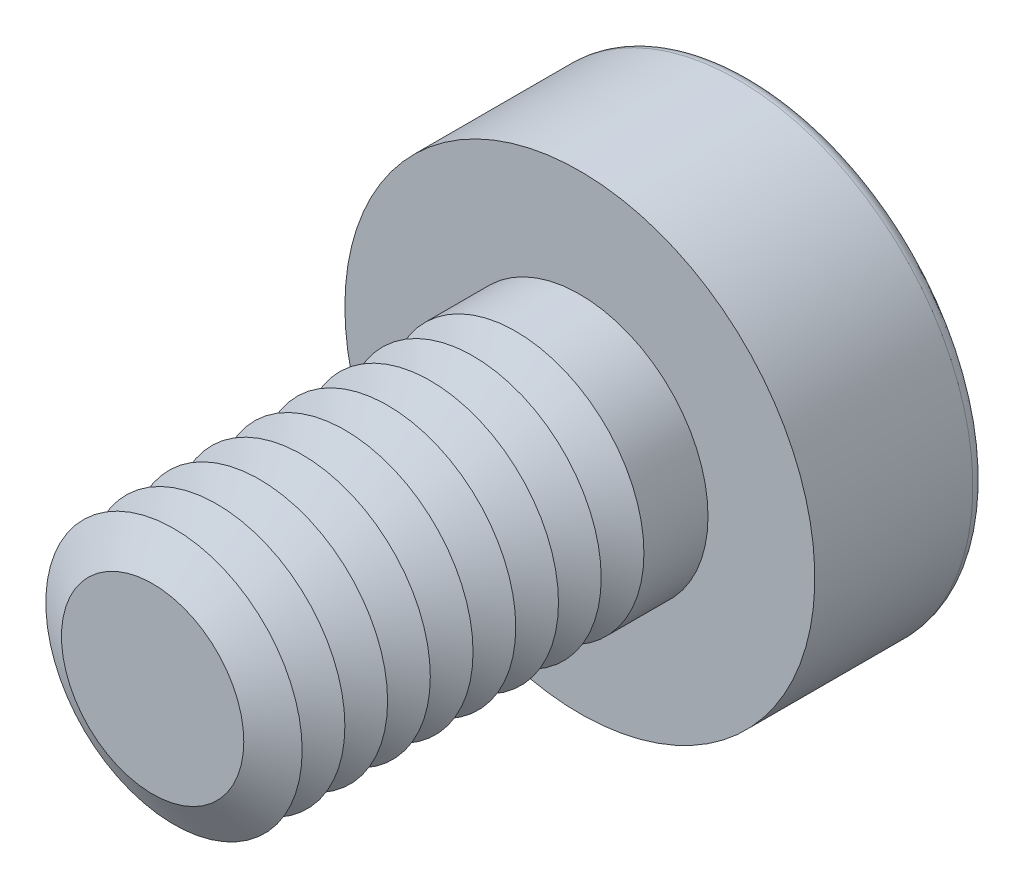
ISO-10303-21;
HEADER;
FILE_DESCRIPTION(('STEP AP214'),'2;1');
FILE_NAME('part.step','',(''),(''),'','','');
FILE_SCHEMA(('AUTOMOTIVE_DESIGN { 1 0 10303 214 1 1 1 1 }'));
ENDSEC;
DATA;
#1=APPLICATION_CONTEXT('core data for automotive mechanical design processes');
#2=APPLICATION_PROTOCOL_DEFINITION('international standard','automotive_design',2000,#1);
#3=PRODUCT_CONTEXT('',#1,'mechanical');
#4=PRODUCT('Part','Part','',(#3));
#5=PRODUCT_RELATED_PRODUCT_CATEGORY('part','',(#4));
#6=PRODUCT_DEFINITION_FORMATION('','',#4);
#7=PRODUCT_DEFINITION_CONTEXT('part definition',#1,'design');
#8=PRODUCT_DEFINITION('design','',#6,#7);
#9=PRODUCT_DEFINITION_SHAPE('','',#8);
#10=(LENGTH_UNIT() NAMED_UNIT(*) SI_UNIT(.MILLI.,.METRE.));
#11=(NAMED_UNIT(*) PLANE_ANGLE_UNIT() SI_UNIT($,.RADIAN.));
#12=(NAMED_UNIT(*) SI_UNIT($,.STERADIAN.) SOLID_ANGLE_UNIT());
#13=UNCERTAINTY_MEASURE_WITH_UNIT(LENGTH_MEASURE(1.E-05),#10,'distance_accuracy_value','');
#14=(GEOMETRIC_REPRESENTATION_CONTEXT(3) GLOBAL_UNCERTAINTY_ASSIGNED_CONTEXT((#13)) GLOBAL_UNIT_ASSIGNED_CONTEXT((#10,
#11,#12)) REPRESENTATION_CONTEXT('',''));
#15=CARTESIAN_POINT('',(0.,0.,0.));
#16=DIRECTION('',(0.,0.,1.));
#17=DIRECTION('',(1.,0.,0.));
#18=AXIS2_PLACEMENT_3D('',#15,#16,#17);
#19=CARTESIAN_POINT('',(0.,0.,3.25));
#20=DIRECTION('',(0.,0.,1.));
#21=DIRECTION('',(1.,0.,0.));
#22=AXIS2_PLACEMENT_3D('',#19,#20,#21);
#23=CONICAL_SURFACE('',#22,1.5,1.0471975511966);
#24=CARTESIAN_POINT('',(0.,0.,3.));
#25=DIRECTION('',(0.,0.,1.));
#26=DIRECTION('',(1.,0.,0.));
#27=AXIS2_PLACEMENT_3D('',#24,#25,#26);
#28=CIRCLE('',#27,1.06698729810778);
#29=CARTESIAN_POINT('',(1.06698729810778,0.,3.));
#30=VERTEX_POINT('',#29);
#31=EDGE_CURVE('E313',#30,#30,#28,.T.);
#32=ORIENTED_EDGE('',*,*,#31,.T.);
#33=EDGE_LOOP('',(#32));
#34=FACE_BOUND('',#33,.T.);
#35=CARTESIAN_POINT('',(0.,0.,3.25));
#36=DIRECTION('',(0.,0.,1.));
#37=DIRECTION('',(1.,0.,0.));
#38=AXIS2_PLACEMENT_3D('',#35,#36,#37);
#39=CIRCLE('',#38,1.5);
#40=CARTESIAN_POINT('',(1.5,0.,3.25));
#41=VERTEX_POINT('',#40);
#42=EDGE_CURVE('E316',#41,#41,#39,.T.);
#43=ORIENTED_EDGE('',*,*,#42,.F.);
#44=EDGE_LOOP('',(#43));
#45=FACE_BOUND('',#44,.T.);
#46=ADVANCED_FACE('F39',(#34,#45),#23,.T.);
#47=CARTESIAN_POINT('',(0.,0.,3.));
#48=DIRECTION('',(0.,0.,-1.));
#49=DIRECTION('',(-1.,0.,0.));
#50=AXIS2_PLACEMENT_3D('',#47,#48,#49);
#51=CONICAL_SURFACE('',#50,1.06698729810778,1.0471975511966);
#52=CARTESIAN_POINT('',(0.,0.,2.75));
#53=DIRECTION('',(0.,0.,1.));
#54=DIRECTION('',(1.,0.,0.));
#55=AXIS2_PLACEMENT_3D('',#52,#53,#54);
#56=CIRCLE('',#55,1.5);
#57=CARTESIAN_POINT('',(1.5,0.,2.75));
#58=VERTEX_POINT('',#57);
#59=EDGE_CURVE('E324',#58,#58,#56,.T.);
#60=ORIENTED_EDGE('',*,*,#59,.T.);
#61=EDGE_LOOP('',(#60));
#62=FACE_BOUND('',#61,.T.);
#63=ORIENTED_EDGE('',*,*,#31,.F.);
#64=EDGE_LOOP('',(#63));
#65=FACE_BOUND('',#64,.T.);
#66=ADVANCED_FACE('F244',(#62,#65),#51,.T.);
#67=CARTESIAN_POINT('',(0.,0.,5.));
#68=DIRECTION('',(0.,0.,1.));
#69=DIRECTION('',(1.,0.,0.));
#70=AXIS2_PLACEMENT_3D('',#67,#68,#69);
#71=PLANE('',#70);
#72=CARTESIAN_POINT('',(0.,0.,5.));
#73=DIRECTION('',(0.,0.,1.));
#74=DIRECTION('',(1.,0.,0.));
#75=AXIS2_PLACEMENT_3D('',#72,#73,#74);
#76=CIRCLE('',#75,1.06698729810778);
#77=CARTESIAN_POINT('',(1.06698729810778,0.,5.));
#78=VERTEX_POINT('',#77);
#79=EDGE_CURVE('E173',#78,#78,#76,.T.);
#80=ORIENTED_EDGE('',*,*,#79,.T.);
#81=EDGE_LOOP('',(#80));
#82=FACE_BOUND('',#81,.T.);
#83=ADVANCED_FACE('F250',(#82),#71,.T.);
#84=CARTESIAN_POINT('',(0.,0.,5.));
#85=DIRECTION('',(0.,0.,-1.));
#86=DIRECTION('',(-1.,0.,0.));
#87=AXIS2_PLACEMENT_3D('',#84,#85,#86);
#88=CONICAL_SURFACE('',#87,1.06698729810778,1.0471975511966);
#89=CARTESIAN_POINT('',(0.,0.,4.75));
#90=DIRECTION('',(0.,0.,1.));
#91=DIRECTION('',(1.,0.,0.));
#92=AXIS2_PLACEMENT_3D('',#89,#90,#91);
#93=CIRCLE('',#92,1.5);
#94=CARTESIAN_POINT('',(1.5,0.,4.75));
#95=VERTEX_POINT('',#94);
#96=EDGE_CURVE('E290',#95,#95,#93,.T.);
#97=ORIENTED_EDGE('',*,*,#96,.T.);
#98=EDGE_LOOP('',(#97));
#99=FACE_BOUND('',#98,.T.);
#100=ORIENTED_EDGE('',*,*,#79,.F.);
#101=EDGE_LOOP('',(#100));
#102=FACE_BOUND('',#101,.T.);
#103=ADVANCED_FACE('F198',(#99,#102),#88,.T.);
#104=CARTESIAN_POINT('',(0.,0.,4.75));
#105=DIRECTION('',(0.,0.,1.));
#106=DIRECTION('',(1.,0.,0.));
#107=AXIS2_PLACEMENT_3D('',#104,#105,#106);
#108=CONICAL_SURFACE('',#107,1.5,1.0471975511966);
#109=CARTESIAN_POINT('',(0.,0.,4.5));
#110=DIRECTION('',(0.,0.,1.));
#111=DIRECTION('',(1.,0.,0.));
#112=AXIS2_PLACEMENT_3D('',#109,#110,#111);
#113=CIRCLE('',#112,1.06698729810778);
#114=CARTESIAN_POINT('',(1.06698729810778,0.,4.5));
#115=VERTEX_POINT('',#114);
#116=EDGE_CURVE('E287',#115,#115,#113,.T.);
#117=ORIENTED_EDGE('',*,*,#116,.T.);
#118=EDGE_LOOP('',(#117));
#119=FACE_BOUND('',#118,.T.);
#120=ORIENTED_EDGE('',*,*,#96,.F.);
#121=EDGE_LOOP('',(#120));
#122=FACE_BOUND('',#121,.T.);
#123=ADVANCED_FACE('F276',(#119,#122),#108,.T.);
#124=CARTESIAN_POINT('',(0.,0.,4.5));
#125=DIRECTION('',(0.,0.,-1.));
#126=DIRECTION('',(-1.,0.,0.));
#127=AXIS2_PLACEMENT_3D('',#124,#125,#126);
#128=CONICAL_SURFACE('',#127,1.06698729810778,1.0471975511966);
#129=CARTESIAN_POINT('',(0.,0.,4.25));
#130=DIRECTION('',(0.,0.,1.));
#131=DIRECTION('',(1.,0.,0.));
#132=AXIS2_PLACEMENT_3D('',#129,#130,#131);
#133=CIRCLE('',#132,1.5);
#134=CARTESIAN_POINT('',(1.5,0.,4.25));
#135=VERTEX_POINT('',#134);
#136=EDGE_CURVE('E299',#135,#135,#133,.T.);
#137=ORIENTED_EDGE('',*,*,#136,.T.);
#138=EDGE_LOOP('',(#137));
#139=FACE_BOUND('',#138,.T.);
#140=ORIENTED_EDGE('',*,*,#116,.F.);
#141=EDGE_LOOP('',(#140));
#142=FACE_BOUND('',#141,.T.);
#143=ADVANCED_FACE('F273',(#139,#142),#128,.T.);
#144=CARTESIAN_POINT('',(0.,0.,4.25));
#145=DIRECTION('',(0.,0.,1.));
#146=DIRECTION('',(1.,0.,0.));
#147=AXIS2_PLACEMENT_3D('',#144,#145,#146);
#148=CONICAL_SURFACE('',#147,1.5,1.0471975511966);
#149=CARTESIAN_POINT('',(0.,0.,4.));
#150=DIRECTION('',(0.,0.,1.));
#151=DIRECTION('',(1.,0.,0.));
#152=AXIS2_PLACEMENT_3D('',#149,#150,#151);
#153=CIRCLE('',#152,1.06698729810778);
#154=CARTESIAN_POINT('',(1.06698729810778,0.,4.));
#155=VERTEX_POINT('',#154);
#156=EDGE_CURVE('E292',#155,#155,#153,.T.);
#157=ORIENTED_EDGE('',*,*,#156,.T.);
#158=EDGE_LOOP('',(#157));
#159=FACE_BOUND('',#158,.T.);
#160=ORIENTED_EDGE('',*,*,#136,.F.);
#161=EDGE_LOOP('',(#160));
#162=FACE_BOUND('',#161,.T.);
#163=ADVANCED_FACE('F269',(#159,#162),#148,.T.);
#164=CARTESIAN_POINT('',(0.,0.,4.));
#165=DIRECTION('',(0.,0.,-1.));
#166=DIRECTION('',(-1.,0.,0.));
#167=AXIS2_PLACEMENT_3D('',#164,#165,#166);
#168=CONICAL_SURFACE('',#167,1.06698729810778,1.0471975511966);
#169=CARTESIAN_POINT('',(0.,0.,3.75));
#170=DIRECTION('',(0.,0.,1.));
#171=DIRECTION('',(1.,0.,0.));
#172=AXIS2_PLACEMENT_3D('',#169,#170,#171);
#173=CIRCLE('',#172,1.5);
#174=CARTESIAN_POINT('',(1.5,0.,3.75));
#175=VERTEX_POINT('',#174);
#176=EDGE_CURVE('E309',#175,#175,#173,.T.);
#177=ORIENTED_EDGE('',*,*,#176,.T.);
#178=EDGE_LOOP('',(#177));
#179=FACE_BOUND('',#178,.T.);
#180=ORIENTED_EDGE('',*,*,#156,.F.);
#181=EDGE_LOOP('',(#180));
#182=FACE_BOUND('',#181,.T.);
#183=ADVANCED_FACE('F265',(#179,#182),#168,.T.);
#184=CARTESIAN_POINT('',(0.,0.,3.75));
#185=DIRECTION('',(0.,0.,1.));
#186=DIRECTION('',(1.,0.,0.));
#187=AXIS2_PLACEMENT_3D('',#184,#185,#186);
#188=CONICAL_SURFACE('',#187,1.5,1.0471975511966);
#189=CARTESIAN_POINT('',(0.,0.,3.5));
#190=DIRECTION('',(0.,0.,1.));
#191=DIRECTION('',(1.,0.,0.));
#192=AXIS2_PLACEMENT_3D('',#189,#190,#191);
#193=CIRCLE('',#192,1.06698729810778);
#194=CARTESIAN_POINT('',(1.06698729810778,0.,3.5));
#195=VERTEX_POINT('',#194);
#196=EDGE_CURVE('E305',#195,#195,#193,.T.);
#197=ORIENTED_EDGE('',*,*,#196,.T.);
#198=EDGE_LOOP('',(#197));
#199=FACE_BOUND('',#198,.T.);
#200=ORIENTED_EDGE('',*,*,#176,.F.);
#201=EDGE_LOOP('',(#200));
#202=FACE_BOUND('',#201,.T.);
#203=ADVANCED_FACE('F261',(#199,#202),#188,.T.);
#204=CARTESIAN_POINT('',(0.,0.,3.5));
#205=DIRECTION('',(0.,0.,-1.));
#206=DIRECTION('',(-1.,0.,0.));
#207=AXIS2_PLACEMENT_3D('',#204,#205,#206);
#208=CONICAL_SURFACE('',#207,1.06698729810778,1.0471975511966);
#209=ORIENTED_EDGE('',*,*,#42,.T.);
#210=EDGE_LOOP('',(#209));
#211=FACE_BOUND('',#210,.T.);
#212=ORIENTED_EDGE('',*,*,#196,.F.);
#213=EDGE_LOOP('',(#212));
#214=FACE_BOUND('',#213,.T.);
#215=ADVANCED_FACE('F257',(#211,#214),#208,.T.);
#216=CARTESIAN_POINT('',(0.,0.,2.75));
#217=DIRECTION('',(0.,0.,1.));
#218=DIRECTION('',(1.,0.,0.));
#219=AXIS2_PLACEMENT_3D('',#216,#217,#218);
#220=CONICAL_SURFACE('',#219,1.5,1.0471975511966);
#221=CARTESIAN_POINT('',(0.,0.,2.5));
#222=DIRECTION('',(0.,0.,1.));
#223=DIRECTION('',(1.,0.,0.));
#224=AXIS2_PLACEMENT_3D('',#221,#222,#223);
#225=CIRCLE('',#224,1.06698729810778);
#226=CARTESIAN_POINT('',(1.06698729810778,0.,2.5));
#227=VERTEX_POINT('',#226);
#228=EDGE_CURVE('E320',#227,#227,#225,.T.);
#229=ORIENTED_EDGE('',*,*,#228,.T.);
#230=EDGE_LOOP('',(#229));
#231=FACE_BOUND('',#230,.T.);
#232=ORIENTED_EDGE('',*,*,#59,.F.);
#233=EDGE_LOOP('',(#232));
#234=FACE_BOUND('',#233,.T.);
#235=ADVANCED_FACE('F260',(#231,#234),#220,.T.);
#236=CARTESIAN_POINT('',(0.,0.,2.5));
#237=DIRECTION('',(0.,0.,-1.));
#238=DIRECTION('',(-1.,0.,0.));
#239=AXIS2_PLACEMENT_3D('',#236,#237,#238);
#240=CONICAL_SURFACE('',#239,1.06698729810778,1.0471975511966);
#241=CARTESIAN_POINT('',(0.,0.,2.25));
#242=DIRECTION('',(0.,0.,1.));
#243=DIRECTION('',(1.,0.,0.));
#244=AXIS2_PLACEMENT_3D('',#241,#242,#243);
#245=CIRCLE('',#244,1.5);
#246=CARTESIAN_POINT('',(1.5,0.,2.25));
#247=VERTEX_POINT('',#246);
#248=EDGE_CURVE('E332',#247,#247,#245,.T.);
#249=ORIENTED_EDGE('',*,*,#248,.T.);
#250=EDGE_LOOP('',(#249));
#251=FACE_BOUND('',#250,.T.);
#252=ORIENTED_EDGE('',*,*,#228,.F.);
#253=EDGE_LOOP('',(#252));
#254=FACE_BOUND('',#253,.T.);
#255=ADVANCED_FACE('F386',(#251,#254),#240,.T.);
#256=CARTESIAN_POINT('',(0.,0.,2.25));
#257=DIRECTION('',(0.,0.,1.));
#258=DIRECTION('',(1.,0.,0.));
#259=AXIS2_PLACEMENT_3D('',#256,#257,#258);
#260=CONICAL_SURFACE('',#259,1.5,1.0471975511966);
#261=CARTESIAN_POINT('',(0.,0.,2.));
#262=DIRECTION('',(0.,0.,1.));
#263=DIRECTION('',(1.,0.,0.));
#264=AXIS2_PLACEMENT_3D('',#261,#262,#263);
#265=CIRCLE('',#264,1.06698729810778);
#266=CARTESIAN_POINT('',(1.06698729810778,0.,2.));
#267=VERTEX_POINT('',#266);
#268=EDGE_CURVE('E328',#267,#267,#265,.T.);
#269=ORIENTED_EDGE('',*,*,#268,.T.);
#270=EDGE_LOOP('',(#269));
#271=FACE_BOUND('',#270,.T.);
#272=ORIENTED_EDGE('',*,*,#248,.F.);
#273=EDGE_LOOP('',(#272));
#274=FACE_BOUND('',#273,.T.);
#275=ADVANCED_FACE('F382',(#271,#274),#260,.T.);
#276=CARTESIAN_POINT('',(0.,0.,2.));
#277=DIRECTION('',(0.,0.,-1.));
#278=DIRECTION('',(-1.,0.,0.));
#279=AXIS2_PLACEMENT_3D('',#276,#277,#278);
#280=CONICAL_SURFACE('',#279,1.06698729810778,1.0471975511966);
#281=CARTESIAN_POINT('',(0.,0.,1.75));
#282=DIRECTION('',(0.,0.,1.));
#283=DIRECTION('',(1.,0.,0.));
#284=AXIS2_PLACEMENT_3D('',#281,#282,#283);
#285=CIRCLE('',#284,1.5);
#286=CARTESIAN_POINT('',(1.5,0.,1.75));
#287=VERTEX_POINT('',#286);
#288=EDGE_CURVE('E340',#287,#287,#285,.T.);
#289=ORIENTED_EDGE('',*,*,#288,.T.);
#290=EDGE_LOOP('',(#289));
#291=FACE_BOUND('',#290,.T.);
#292=ORIENTED_EDGE('',*,*,#268,.F.);
#293=EDGE_LOOP('',(#292));
#294=FACE_BOUND('',#293,.T.);
#295=ADVANCED_FACE('F378',(#291,#294),#280,.T.);
#296=CARTESIAN_POINT('',(0.,0.,1.75));
#297=DIRECTION('',(0.,0.,1.));
#298=DIRECTION('',(1.,0.,0.));
#299=AXIS2_PLACEMENT_3D('',#296,#297,#298);
#300=CONICAL_SURFACE('',#299,1.5,1.0471975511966);
#301=CARTESIAN_POINT('',(0.,0.,1.5));
#302=DIRECTION('',(0.,0.,1.));
#303=DIRECTION('',(1.,0.,0.));
#304=AXIS2_PLACEMENT_3D('',#301,#302,#303);
#305=CIRCLE('',#304,1.06698729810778);
#306=CARTESIAN_POINT('',(1.06698729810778,0.,1.5));
#307=VERTEX_POINT('',#306);
#308=EDGE_CURVE('E336',#307,#307,#305,.T.);
#309=ORIENTED_EDGE('',*,*,#308,.T.);
#310=EDGE_LOOP('',(#309));
#311=FACE_BOUND('',#310,.T.);
#312=ORIENTED_EDGE('',*,*,#288,.F.);
#313=EDGE_LOOP('',(#312));
#314=FACE_BOUND('',#313,.T.);
#315=ADVANCED_FACE('F373',(#311,#314),#300,.T.);
#316=CARTESIAN_POINT('',(0.,0.,1.5));
#317=DIRECTION('',(0.,0.,-1.));
#318=DIRECTION('',(-1.,0.,0.));
#319=AXIS2_PLACEMENT_3D('',#316,#317,#318);
#320=CONICAL_SURFACE('',#319,1.06698729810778,1.0471975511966);
#321=CARTESIAN_POINT('',(0.,0.,1.25));
#322=DIRECTION('',(0.,0.,1.));
#323=DIRECTION('',(1.,0.,0.));
#324=AXIS2_PLACEMENT_3D('',#321,#322,#323);
#325=CIRCLE('',#324,1.5);
#326=CARTESIAN_POINT('',(1.5,0.,1.25));
#327=VERTEX_POINT('',#326);
#328=EDGE_CURVE('E352',#327,#327,#325,.T.);
#329=ORIENTED_EDGE('',*,*,#328,.T.);
#330=EDGE_LOOP('',(#329));
#331=FACE_BOUND('',#330,.T.);
#332=ORIENTED_EDGE('',*,*,#308,.F.);
#333=EDGE_LOOP('',(#332));
#334=FACE_BOUND('',#333,.T.);
#335=ADVANCED_FACE('F359',(#331,#334),#320,.T.);
#336=CARTESIAN_POINT('',(0.,0.,1.25));
#337=DIRECTION('',(0.,0.,1.));
#338=DIRECTION('',(1.,0.,0.));
#339=AXIS2_PLACEMENT_3D('',#336,#337,#338);
#340=CONICAL_SURFACE('',#339,1.5,1.0471975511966);
#341=CARTESIAN_POINT('',(0.,0.,1.));
#342=DIRECTION('',(0.,0.,1.));
#343=DIRECTION('',(1.,0.,0.));
#344=AXIS2_PLACEMENT_3D('',#341,#342,#343);
#345=CIRCLE('',#344,1.06698729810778);
#346=CARTESIAN_POINT('',(1.06698729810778,0.,1.));
#347=VERTEX_POINT('',#346);
#348=EDGE_CURVE('E344',#347,#347,#345,.T.);
#349=ORIENTED_EDGE('',*,*,#348,.T.);
#350=EDGE_LOOP('',(#349));
#351=FACE_BOUND('',#350,.T.);
#352=ORIENTED_EDGE('',*,*,#328,.F.);
#353=EDGE_LOOP('',(#352));
#354=FACE_BOUND('',#353,.T.);
#355=ADVANCED_FACE('F362',(#351,#354),#340,.T.);
#356=CARTESIAN_POINT('',(0.,0.,1.));
#357=DIRECTION('',(0.,0.,-1.));
#358=DIRECTION('',(-1.,0.,0.));
#359=AXIS2_PLACEMENT_3D('',#356,#357,#358);
#360=CONICAL_SURFACE('',#359,1.06698729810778,1.0471975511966);
#361=CARTESIAN_POINT('',(0.,0.,0.750000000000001));
#362=DIRECTION('',(0.,0.,1.));
#363=DIRECTION('',(1.,0.,0.));
#364=AXIS2_PLACEMENT_3D('',#361,#362,#363);
#365=CIRCLE('',#364,1.5);
#366=CARTESIAN_POINT('',(1.5,0.,0.750000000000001));
#367=VERTEX_POINT('',#366);
#368=EDGE_CURVE('E348',#367,#367,#365,.T.);
#369=ORIENTED_EDGE('',*,*,#368,.T.);
#370=EDGE_LOOP('',(#369));
#371=FACE_BOUND('',#370,.T.);
#372=ORIENTED_EDGE('',*,*,#348,.F.);
#373=EDGE_LOOP('',(#372));
#374=FACE_BOUND('',#373,.T.);
#375=ADVANCED_FACE('F364',(#371,#374),#360,.T.);
#376=CARTESIAN_POINT('',(0.,0.,-0.5));
#377=DIRECTION('',(0.,0.,-1.));
#378=DIRECTION('',(-1.,0.,0.));
#379=AXIS2_PLACEMENT_3D('',#376,#377,#378);
#380=CONICAL_SURFACE('',#379,0.999999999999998,1.0471975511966);
#381=CARTESIAN_POINT('',(0.,0.,0.0773502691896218));
#382=VERTEX_POINT('',#381);
#383=VERTEX_LOOP('',#382);
#384=FACE_BOUND('',#383,.T.);
#385=CARTESIAN_POINT('',(0.,0.,-0.5));
#386=DIRECTION('',(0.,0.,-1.));
#387=DIRECTION('',(-1.,0.,0.));
#388=AXIS2_PLACEMENT_3D('',#385,#386,#387);
#389=CIRCLE('',#388,0.999999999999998);
#390=CARTESIAN_POINT('',(-0.866025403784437,0.499999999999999,-0.5));
#391=VERTEX_POINT('',#390);
#392=CARTESIAN_POINT('',(0.,0.999999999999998,-0.5));
#393=VERTEX_POINT('',#392);
#394=EDGE_CURVE('E149',#391,#393,#389,.T.);
#395=ORIENTED_EDGE('',*,*,#394,.T.);
#396=CARTESIAN_POINT('',(0.,0.,-0.5));
#397=DIRECTION('',(0.,0.,-1.));
#398=DIRECTION('',(-1.,0.,0.));
#399=AXIS2_PLACEMENT_3D('',#396,#397,#398);
#400=CIRCLE('',#399,0.999999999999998);
#401=CARTESIAN_POINT('',(0.866025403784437,0.499999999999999,-0.5));
#402=VERTEX_POINT('',#401);
#403=EDGE_CURVE('E54',#393,#402,#400,.T.);
#404=ORIENTED_EDGE('',*,*,#403,.T.);
#405=CARTESIAN_POINT('',(0.866025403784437,-0.499999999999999,-0.5));
#406=VERTEX_POINT('',#405);
#407=EDGE_CURVE('E790',#402,#406,#400,.T.);
#408=ORIENTED_EDGE('',*,*,#407,.T.);
#409=CARTESIAN_POINT('',(0.,-0.999999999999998,-0.5));
#410=VERTEX_POINT('',#409);
#411=EDGE_CURVE('E788',#406,#410,#400,.T.);
#412=ORIENTED_EDGE('',*,*,#411,.T.);
#413=CARTESIAN_POINT('',(-0.866025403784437,-0.499999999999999,-0.5));
#414=VERTEX_POINT('',#413);
#415=EDGE_CURVE('E783',#410,#414,#400,.T.);
#416=ORIENTED_EDGE('',*,*,#415,.T.);
#417=EDGE_CURVE('E781',#414,#391,#400,.T.);
#418=ORIENTED_EDGE('',*,*,#417,.T.);
#419=EDGE_LOOP('',(#395,#404,#408,#412,#416,#418));
#420=FACE_BOUND('',#419,.T.);
#421=ADVANCED_FACE('F200',(#384,#420),#380,.F.);
#422=CARTESIAN_POINT('',(0.,0.,-0.5));
#423=DIRECTION('',(0.,0.,-1.));
#424=DIRECTION('',(-1.,0.,0.));
#425=AXIS2_PLACEMENT_3D('',#422,#423,#424);
#426=PLANE('',#425);
#427=ORIENTED_EDGE('',*,*,#403,.F.);
#428=DIRECTION('',(1.,0.,0.));
#429=VECTOR('',#428,1.);
#430=CARTESIAN_POINT('',(-0.577350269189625,1.,-0.5));
#431=LINE('',#430,#429);
#432=CARTESIAN_POINT('',(0.577350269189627,1.,-0.5));
#433=VERTEX_POINT('',#432);
#434=EDGE_CURVE('E825',#393,#433,#431,.T.);
#435=ORIENTED_EDGE('',*,*,#434,.T.);
#436=DIRECTION('',(0.5,-0.866025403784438,0.));
#437=VECTOR('',#436,1.);
#438=CARTESIAN_POINT('',(0.577350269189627,1.,-0.5));
#439=LINE('',#438,#437);
#440=EDGE_CURVE('E155',#433,#402,#439,.T.);
#441=ORIENTED_EDGE('',*,*,#440,.T.);
#442=EDGE_LOOP('',(#427,#435,#441));
#443=FACE_BOUND('',#442,.T.);
#444=ADVANCED_FACE('F433',(#443),#426,.T.);
#445=ORIENTED_EDGE('',*,*,#407,.F.);
#446=CARTESIAN_POINT('',(1.15470053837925,0.,-0.5));
#447=VERTEX_POINT('',#446);
#448=EDGE_CURVE('E822',#402,#447,#439,.T.);
#449=ORIENTED_EDGE('',*,*,#448,.T.);
#450=DIRECTION('',(-0.5,-0.866025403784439,0.));
#451=VECTOR('',#450,1.);
#452=CARTESIAN_POINT('',(1.15470053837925,0.,-0.5));
#453=LINE('',#452,#451);
#454=EDGE_CURVE('E801',#447,#406,#453,.T.);
#455=ORIENTED_EDGE('',*,*,#454,.T.);
#456=EDGE_LOOP('',(#445,#449,#455));
#457=FACE_BOUND('',#456,.T.);
#458=ADVANCED_FACE('F443',(#457),#426,.T.);
#459=ORIENTED_EDGE('',*,*,#411,.F.);
#460=CARTESIAN_POINT('',(0.577350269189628,-1.,-0.5));
#461=VERTEX_POINT('',#460);
#462=EDGE_CURVE('E803',#406,#461,#453,.T.);
#463=ORIENTED_EDGE('',*,*,#462,.T.);
#464=DIRECTION('',(-1.,0.,0.));
#465=VECTOR('',#464,1.);
#466=CARTESIAN_POINT('',(0.577350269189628,-1.,-0.5));
#467=LINE('',#466,#465);
#468=EDGE_CURVE('E755',#461,#410,#467,.T.);
#469=ORIENTED_EDGE('',*,*,#468,.T.);
#470=EDGE_LOOP('',(#459,#463,#469));
#471=FACE_BOUND('',#470,.T.);
#472=ADVANCED_FACE('F453',(#471),#426,.T.);
#473=ORIENTED_EDGE('',*,*,#415,.F.);
#474=CARTESIAN_POINT('',(-0.577350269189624,-0.999999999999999,-0.5));
#475=VERTEX_POINT('',#474);
#476=EDGE_CURVE('E798',#410,#475,#467,.T.);
#477=ORIENTED_EDGE('',*,*,#476,.T.);
#478=DIRECTION('',(-0.5,0.866025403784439,0.));
#479=VECTOR('',#478,1.);
#480=CARTESIAN_POINT('',(-0.577350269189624,-0.999999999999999,-0.5));
#481=LINE('',#480,#479);
#482=EDGE_CURVE('E800',#475,#414,#481,.T.);
#483=ORIENTED_EDGE('',*,*,#482,.T.);
#484=EDGE_LOOP('',(#473,#477,#483));
#485=FACE_BOUND('',#484,.T.);
#486=ADVANCED_FACE('F461',(#485),#426,.T.);
#487=ORIENTED_EDGE('',*,*,#417,.F.);
#488=CARTESIAN_POINT('',(-1.15470053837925,0.,-0.5));
#489=VERTEX_POINT('',#488);
#490=EDGE_CURVE('E804',#414,#489,#481,.T.);
#491=ORIENTED_EDGE('',*,*,#490,.T.);
#492=DIRECTION('',(0.5,0.866025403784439,0.));
#493=VECTOR('',#492,1.);
#494=CARTESIAN_POINT('',(-1.15470053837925,0.,-0.5));
#495=LINE('',#494,#493);
#496=EDGE_CURVE('E158',#489,#391,#495,.T.);
#497=ORIENTED_EDGE('',*,*,#496,.T.);
#498=EDGE_LOOP('',(#487,#491,#497));
#499=FACE_BOUND('',#498,.T.);
#500=ADVANCED_FACE('F230',(#499),#426,.T.);
#501=ORIENTED_EDGE('',*,*,#394,.F.);
#502=CARTESIAN_POINT('',(-0.577350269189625,1.,-0.5));
#503=VERTEX_POINT('',#502);
#504=EDGE_CURVE('E811',#391,#503,#495,.T.);
#505=ORIENTED_EDGE('',*,*,#504,.T.);
#506=EDGE_CURVE('E826',#503,#393,#431,.T.);
#507=ORIENTED_EDGE('',*,*,#506,.T.);
#508=EDGE_LOOP('',(#501,#505,#507));
#509=FACE_BOUND('',#508,.T.);
#510=ADVANCED_FACE('F445',(#509),#426,.T.);
#511=CARTESIAN_POINT('',(-0.577350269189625,1.,-0.5));
#512=DIRECTION('',(0.,1.,0.));
#513=DIRECTION('',(0.,0.,1.));
#514=AXIS2_PLACEMENT_3D('',#511,#512,#513);
#515=PLANE('',#514);
#516=DIRECTION('',(0.,0.,-1.));
#517=VECTOR('',#516,1.);
#518=CARTESIAN_POINT('',(-0.577350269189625,1.,-0.5));
#519=LINE('',#518,#517);
#520=CARTESIAN_POINT('',(-0.577350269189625,1.,-2.));
#521=VERTEX_POINT('',#520);
#522=EDGE_CURVE('E147',#503,#521,#519,.T.);
#523=ORIENTED_EDGE('',*,*,#522,.T.);
#524=CARTESIAN_POINT('',(-1.50720379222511,1.,-2.17525844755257));
#525=CARTESIAN_POINT('',(-1.46204888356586,1.,-2.16517814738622));
#526=CARTESIAN_POINT('',(-1.41686530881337,1.,-2.15522625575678));
#527=CARTESIAN_POINT('',(-1.32642642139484,1.,-2.13564428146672));
#528=CARTESIAN_POINT('',(-1.28117110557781,1.,-2.12601421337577));
#529=CARTESIAN_POINT('',(-1.14519006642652,1.,-2.09768643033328));
#530=CARTESIAN_POINT('',(-1.05434091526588,1.,-2.07957187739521));
#531=CARTESIAN_POINT('',(-0.87298578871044,1.,-2.04585879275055));
#532=CARTESIAN_POINT('',(-0.782483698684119,1.,-2.03023975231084));
#533=CARTESIAN_POINT('',(-0.600935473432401,1.,-2.00256781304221));
#534=CARTESIAN_POINT('',(-0.509889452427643,1.,-1.99051419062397));
#535=CARTESIAN_POINT('',(-0.326198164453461,1.,-1.9715245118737));
#536=CARTESIAN_POINT('',(-0.233546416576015,1.,-1.96464740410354));
#537=CARTESIAN_POINT('',(-0.0480110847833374,1.,-1.95773316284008));
#538=CARTESIAN_POINT('',(0.0448723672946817,1.,-1.95769276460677));
#539=CARTESIAN_POINT('',(0.230753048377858,1.,-1.96446847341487));
#540=CARTESIAN_POINT('',(0.323749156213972,1.,-1.97131296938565));
#541=CARTESIAN_POINT('',(0.509217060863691,1.,-1.99040362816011));
#542=CARTESIAN_POINT('',(0.601688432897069,1.,-2.00265366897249));
#543=CARTESIAN_POINT('',(0.788469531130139,1.,-2.0311825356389));
#544=CARTESIAN_POINT('',(0.882763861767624,1.,-2.04755860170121));
#545=CARTESIAN_POINT('',(1.07089474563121,1.,-2.08278522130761));
#546=CARTESIAN_POINT('',(1.16473122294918,1.,-2.1016361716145));
#547=CARTESIAN_POINT('',(1.35209202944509,1.,-2.14094224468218));
#548=CARTESIAN_POINT('',(1.44561626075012,1.,-2.16139782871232));
#549=CARTESIAN_POINT('',(1.63242626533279,1.,-2.20337233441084));
#550=CARTESIAN_POINT('',(1.72571203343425,1.,-2.22489127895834));
#551=CARTESIAN_POINT('',(1.91097396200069,1.,-2.26839206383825));
#552=CARTESIAN_POINT('',(2.00295221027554,1.,-2.29036504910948));
#553=CARTESIAN_POINT('',(2.18678775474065,1.,-2.3348190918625));
#554=CARTESIAN_POINT('',(2.27864504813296,1.,-2.35730016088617));
#555=CARTESIAN_POINT('',(2.46214009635,1.,-2.40260092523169));
#556=CARTESIAN_POINT('',(2.55377797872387,1.,-2.42542010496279));
#557=CARTESIAN_POINT('',(2.73697957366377,1.,-2.47134052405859));
#558=CARTESIAN_POINT('',(2.82854328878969,1.,-2.49444175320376));
#559=CARTESIAN_POINT('',(2.92008180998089,1.,-2.51764127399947));
#560=B_SPLINE_CURVE_WITH_KNOTS('',3,(#524,#525,#526,#527,#528,#529,#530,#531,#532,#533,#534,
#535,#536,#537,#538,#539,#540,#541,#542,#543,#544,#545,#546,#547,#548,#549,#550,#551,#552,#553,
#554,#555,#556,#557,#558,#559),.UNSPECIFIED.,.F.,.F.,(4,2,2,2,2,2,2,2,2,2,2,2,2,2,2,2,2,4),(0.,
0.138798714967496,0.277603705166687,0.555495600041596,0.830971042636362,1.106390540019,
1.38490086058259,1.66327818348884,1.94280808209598,2.22253884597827,2.50960639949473,
2.79672003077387,3.08391650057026,3.37111915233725,3.65481652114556,3.93852034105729,
4.22182877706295,4.50512697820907),.UNSPECIFIED.);
#561=CARTESIAN_POINT('',(0.577350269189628,0.999999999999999,-2.));
#562=VERTEX_POINT('',#561);
#563=EDGE_CURVE('E124',#521,#562,#560,.T.);
#564=ORIENTED_EDGE('',*,*,#563,.T.);
#565=DIRECTION('',(0.,0.,-1.));
#566=VECTOR('',#565,1.);
#567=CARTESIAN_POINT('',(0.577350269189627,1.,-0.5));
#568=LINE('',#567,#566);
#569=EDGE_CURVE('E143',#433,#562,#568,.T.);
#570=ORIENTED_EDGE('',*,*,#569,.F.);
#571=ORIENTED_EDGE('',*,*,#434,.F.);
#572=ORIENTED_EDGE('',*,*,#506,.F.);
#573=EDGE_LOOP('',(#523,#564,#570,#571,#572));
#574=FACE_BOUND('',#573,.T.);
#575=ADVANCED_FACE('F141',(#574),#515,.F.);
#576=CARTESIAN_POINT('',(0.577350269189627,1.,-0.5));
#577=DIRECTION('',(0.866025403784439,0.5,0.));
#578=DIRECTION('',(-0.5,0.866025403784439,0.));
#579=AXIS2_PLACEMENT_3D('',#576,#577,#578);
#580=PLANE('',#579);
#581=ORIENTED_EDGE('',*,*,#569,.T.);
#582=CARTESIAN_POINT('',(0.577234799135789,1.0002,-2.00003094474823));
#583=CARTESIAN_POINT('',(0.601220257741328,0.958655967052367,-1.99359970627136));
#584=CARTESIAN_POINT('',(0.625249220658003,0.917036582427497,-1.98776108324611));
#585=CARTESIAN_POINT('',(0.673392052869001,0.833650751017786,-1.97750302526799));
#586=CARTESIAN_POINT('',(0.697505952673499,0.79188425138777,-1.97308416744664));
#587=CARTESIAN_POINT('',(0.745672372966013,0.70845756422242,-1.96592373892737));
#588=CARTESIAN_POINT('',(0.769724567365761,0.666797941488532,-1.96317362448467));
#589=CARTESIAN_POINT('',(0.817859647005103,0.583425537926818,-1.95948598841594));
#590=CARTESIAN_POINT('',(0.841942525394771,0.541712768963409,-1.95854811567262));
#591=CARTESIAN_POINT('',(0.890108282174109,0.458287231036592,-1.95854811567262));
#592=CARTESIAN_POINT('',(0.914191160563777,0.416574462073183,-1.95948598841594));
#593=CARTESIAN_POINT('',(0.962326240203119,0.33320205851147,-1.96317362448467));
#594=CARTESIAN_POINT('',(0.986378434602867,0.291542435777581,-1.96592373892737));
#595=CARTESIAN_POINT('',(1.03454485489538,0.208115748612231,-1.97308416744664));
#596=CARTESIAN_POINT('',(1.05865875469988,0.166349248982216,-1.97750302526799));
#597=CARTESIAN_POINT('',(1.10680158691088,0.0829634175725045,-1.98776108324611));
#598=CARTESIAN_POINT('',(1.13083054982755,0.0413440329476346,-1.99359970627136));
#599=CARTESIAN_POINT('',(1.15481600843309,-0.000199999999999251,-2.00003094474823));
#600=B_SPLINE_CURVE_WITH_KNOTS('',3,(#582,#583,#584,#585,#586,#587,#588,#589,#590,#591,#592,
#593,#594,#595,#596,#597,#598,#599),.UNSPECIFIED.,.F.,.F.,(4,2,2,2,2,2,2,2,4),(0.,
0.145207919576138,0.290474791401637,0.434991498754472,0.579480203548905,0.723968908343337,
0.868485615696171,1.01375248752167,1.15896040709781),.UNSPECIFIED.);
#601=CARTESIAN_POINT('',(1.15470053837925,0.,-2.));
#602=VERTEX_POINT('',#601);
#603=EDGE_CURVE('E11',#562,#602,#600,.T.);
#604=ORIENTED_EDGE('',*,*,#603,.T.);
#605=DIRECTION('',(0.,0.,-1.));
#606=VECTOR('',#605,1.);
#607=CARTESIAN_POINT('',(1.15470053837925,0.,-0.5));
#608=LINE('',#607,#606);
#609=EDGE_CURVE('E157',#447,#602,#608,.T.);
#610=ORIENTED_EDGE('',*,*,#609,.F.);
#611=ORIENTED_EDGE('',*,*,#448,.F.);
#612=ORIENTED_EDGE('',*,*,#440,.F.);
#613=EDGE_LOOP('',(#581,#604,#610,#611,#612));
#614=FACE_BOUND('',#613,.T.);
#615=ADVANCED_FACE('F152',(#614),#580,.F.);
#616=CARTESIAN_POINT('',(1.15470053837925,0.,-0.5));
#617=DIRECTION('',(0.866025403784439,-0.5,0.));
#618=DIRECTION('',(0.5,0.866025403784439,0.));
#619=AXIS2_PLACEMENT_3D('',#616,#617,#618);
#620=PLANE('',#619);
#621=ORIENTED_EDGE('',*,*,#609,.T.);
#622=CARTESIAN_POINT('',(1.15481600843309,0.000200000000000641,-2.00003094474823));
#623=CARTESIAN_POINT('',(1.13083054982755,-0.0413440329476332,-1.99359970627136));
#624=CARTESIAN_POINT('',(1.10680158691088,-0.0829634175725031,-1.98776108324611));
#625=CARTESIAN_POINT('',(1.05865875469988,-0.166349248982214,-1.97750302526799));
#626=CARTESIAN_POINT('',(1.03454485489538,-0.20811574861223,-1.97308416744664));
#627=CARTESIAN_POINT('',(0.986378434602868,-0.29154243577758,-1.96592373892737));
#628=CARTESIAN_POINT('',(0.962326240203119,-0.333202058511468,-1.96317362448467));
#629=CARTESIAN_POINT('',(0.914191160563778,-0.416574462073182,-1.95948598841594));
#630=CARTESIAN_POINT('',(0.890108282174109,-0.458287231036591,-1.95854811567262));
#631=CARTESIAN_POINT('',(0.841942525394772,-0.541712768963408,-1.95854811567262));
#632=CARTESIAN_POINT('',(0.817859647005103,-0.583425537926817,-1.95948598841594));
#633=CARTESIAN_POINT('',(0.769724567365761,-0.66679794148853,-1.96317362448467));
#634=CARTESIAN_POINT('',(0.745672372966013,-0.708457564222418,-1.96592373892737));
#635=CARTESIAN_POINT('',(0.6975059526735,-0.791884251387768,-1.97308416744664));
#636=CARTESIAN_POINT('',(0.673392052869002,-0.833650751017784,-1.97750302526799));
#637=CARTESIAN_POINT('',(0.625249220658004,-0.917036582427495,-1.98776108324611));
#638=CARTESIAN_POINT('',(0.601220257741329,-0.958655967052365,-1.99359970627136));
#639=CARTESIAN_POINT('',(0.57723479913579,-1.0002,-2.00003094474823));
#640=B_SPLINE_CURVE_WITH_KNOTS('',3,(#622,#623,#624,#625,#626,#627,#628,#629,#630,#631,#632,
#633,#634,#635,#636,#637,#638,#639),.UNSPECIFIED.,.F.,.F.,(4,2,2,2,2,2,2,2,4),(0.,
0.145207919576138,0.290474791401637,0.434991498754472,0.579480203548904,0.723968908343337,
0.868485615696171,1.01375248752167,1.15896040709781),.UNSPECIFIED.);
#641=CARTESIAN_POINT('',(0.577350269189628,-0.999999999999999,-2.));
#642=VERTEX_POINT('',#641);
#643=EDGE_CURVE('E172',#602,#642,#640,.T.);
#644=ORIENTED_EDGE('',*,*,#643,.T.);
#645=DIRECTION('',(0.,0.,-1.));
#646=VECTOR('',#645,1.);
#647=CARTESIAN_POINT('',(0.577350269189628,-1.,-0.5));
#648=LINE('',#647,#646);
#649=EDGE_CURVE('E750',#461,#642,#648,.T.);
#650=ORIENTED_EDGE('',*,*,#649,.F.);
#651=ORIENTED_EDGE('',*,*,#462,.F.);
#652=ORIENTED_EDGE('',*,*,#454,.F.);
#653=EDGE_LOOP('',(#621,#644,#650,#651,#652));
#654=FACE_BOUND('',#653,.T.);
#655=ADVANCED_FACE('F190',(#654),#620,.F.);
#656=CARTESIAN_POINT('',(0.577350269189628,-1.,-0.5));
#657=DIRECTION('',(0.,-1.,0.));
#658=DIRECTION('',(1.,0.,0.));
#659=AXIS2_PLACEMENT_3D('',#656,#657,#658);
#660=PLANE('',#659);
#661=ORIENTED_EDGE('',*,*,#649,.T.);
#662=CARTESIAN_POINT('',(-1.50720379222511,-0.999999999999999,-2.17525844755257));
#663=CARTESIAN_POINT('',(-1.46204888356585,-0.999999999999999,-2.16517814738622));
#664=CARTESIAN_POINT('',(-1.41686530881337,-0.999999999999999,-2.15522625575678));
#665=CARTESIAN_POINT('',(-1.32642642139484,-0.999999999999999,-2.13564428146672));
#666=CARTESIAN_POINT('',(-1.28117110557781,-0.999999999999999,-2.12601421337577));
#667=CARTESIAN_POINT('',(-1.14519006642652,-0.999999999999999,-2.09768643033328));
#668=CARTESIAN_POINT('',(-1.05434091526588,-0.999999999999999,-2.07957187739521));
#669=CARTESIAN_POINT('',(-0.87298578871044,-0.999999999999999,-2.04585879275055));
#670=CARTESIAN_POINT('',(-0.782483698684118,-0.999999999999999,-2.03023975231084));
#671=CARTESIAN_POINT('',(-0.600935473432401,-0.999999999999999,-2.00256781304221));
#672=CARTESIAN_POINT('',(-0.509889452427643,-0.999999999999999,-1.99051419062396));
#673=CARTESIAN_POINT('',(-0.326198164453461,-0.999999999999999,-1.9715245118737));
#674=CARTESIAN_POINT('',(-0.233546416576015,-0.999999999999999,-1.96464740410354));
#675=CARTESIAN_POINT('',(-0.0480110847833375,-0.999999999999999,-1.95773316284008));
#676=CARTESIAN_POINT('',(0.0448723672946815,-0.999999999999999,-1.95769276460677));
#677=CARTESIAN_POINT('',(0.230753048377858,-0.999999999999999,-1.96446847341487));
#678=CARTESIAN_POINT('',(0.323749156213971,-1.,-1.97131296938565));
#679=CARTESIAN_POINT('',(0.50921706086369,-1.,-1.99040362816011));
#680=CARTESIAN_POINT('',(0.601688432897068,-1.,-2.00265366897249));
#681=CARTESIAN_POINT('',(0.788469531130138,-1.,-2.0311825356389));
#682=CARTESIAN_POINT('',(0.882763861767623,-1.,-2.04755860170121));
#683=CARTESIAN_POINT('',(1.07089474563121,-1.,-2.08278522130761));
#684=CARTESIAN_POINT('',(1.16473122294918,-1.,-2.1016361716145));
#685=CARTESIAN_POINT('',(1.35209202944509,-1.,-2.14094224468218));
#686=CARTESIAN_POINT('',(1.44561626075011,-1.,-2.16139782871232));
#687=CARTESIAN_POINT('',(1.63242626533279,-1.,-2.20337233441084));
#688=CARTESIAN_POINT('',(1.72571203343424,-1.,-2.22489127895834));
#689=CARTESIAN_POINT('',(1.91097396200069,-1.,-2.26839206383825));
#690=CARTESIAN_POINT('',(2.00295221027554,-1.,-2.29036504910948));
#691=CARTESIAN_POINT('',(2.18678775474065,-1.,-2.3348190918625));
#692=CARTESIAN_POINT('',(2.27864504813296,-1.,-2.35730016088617));
#693=CARTESIAN_POINT('',(2.46214009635,-1.,-2.40260092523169));
#694=CARTESIAN_POINT('',(2.55377797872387,-1.,-2.42542010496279));
#695=CARTESIAN_POINT('',(2.73697957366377,-1.,-2.47134052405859));
#696=CARTESIAN_POINT('',(2.82854328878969,-1.,-2.49444175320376));
#697=CARTESIAN_POINT('',(2.92008180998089,-1.,-2.51764127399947));
#698=B_SPLINE_CURVE_WITH_KNOTS('',3,(#662,#663,#664,#665,#666,#667,#668,#669,#670,#671,#672,
#673,#674,#675,#676,#677,#678,#679,#680,#681,#682,#683,#684,#685,#686,#687,#688,#689,#690,#691,
#692,#693,#694,#695,#696,#697),.UNSPECIFIED.,.F.,.F.,(4,2,2,2,2,2,2,2,2,2,2,2,2,2,2,2,2,4),(0.,
0.138798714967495,0.277603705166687,0.555495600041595,0.83097104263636,1.106390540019,
1.38490086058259,1.66327818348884,1.94280808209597,2.22253884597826,2.50960639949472,
2.79672003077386,3.08391650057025,3.37111915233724,3.65481652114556,3.93852034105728,
4.22182877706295,4.50512697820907),.UNSPECIFIED.);
#699=CARTESIAN_POINT('',(-0.577350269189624,-0.999999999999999,-2.));
#700=VERTEX_POINT('',#699);
#701=EDGE_CURVE('E183',#642,#700,#698,.F.);
#702=ORIENTED_EDGE('',*,*,#701,.T.);
#703=DIRECTION('',(0.,0.,-1.));
#704=VECTOR('',#703,1.);
#705=CARTESIAN_POINT('',(-0.577350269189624,-0.999999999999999,-0.5));
#706=LINE('',#705,#704);
#707=EDGE_CURVE('E757',#475,#700,#706,.T.);
#708=ORIENTED_EDGE('',*,*,#707,.F.);
#709=ORIENTED_EDGE('',*,*,#476,.F.);
#710=ORIENTED_EDGE('',*,*,#468,.F.);
#711=EDGE_LOOP('',(#661,#702,#708,#709,#710));
#712=FACE_BOUND('',#711,.T.);
#713=ADVANCED_FACE('F233',(#712),#660,.F.);
#714=CARTESIAN_POINT('',(-0.577350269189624,-0.999999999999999,-0.5));
#715=DIRECTION('',(-0.866025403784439,-0.5,0.));
#716=DIRECTION('',(0.5,-0.866025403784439,0.));
#717=AXIS2_PLACEMENT_3D('',#714,#715,#716);
#718=PLANE('',#717);
#719=ORIENTED_EDGE('',*,*,#707,.T.);
#720=CARTESIAN_POINT('',(-0.577234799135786,-1.0002,-2.00003094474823));
#721=CARTESIAN_POINT('',(-0.601220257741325,-0.958655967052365,-1.99359970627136));
#722=CARTESIAN_POINT('',(-0.625249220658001,-0.917036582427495,-1.98776108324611));
#723=CARTESIAN_POINT('',(-0.673392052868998,-0.833650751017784,-1.97750302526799));
#724=CARTESIAN_POINT('',(-0.697505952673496,-0.791884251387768,-1.97308416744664));
#725=CARTESIAN_POINT('',(-0.74567237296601,-0.708457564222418,-1.96592373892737));
#726=CARTESIAN_POINT('',(-0.769724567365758,-0.66679794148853,-1.96317362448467));
#727=CARTESIAN_POINT('',(-0.8178596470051,-0.583425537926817,-1.95948598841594));
#728=CARTESIAN_POINT('',(-0.841942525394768,-0.541712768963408,-1.95854811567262));
#729=CARTESIAN_POINT('',(-0.890108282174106,-0.45828723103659,-1.95854811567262));
#730=CARTESIAN_POINT('',(-0.914191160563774,-0.416574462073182,-1.95948598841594));
#731=CARTESIAN_POINT('',(-0.962326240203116,-0.333202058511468,-1.96317362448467));
#732=CARTESIAN_POINT('',(-0.986378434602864,-0.29154243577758,-1.96592373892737));
#733=CARTESIAN_POINT('',(-1.03454485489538,-0.20811574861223,-1.97308416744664));
#734=CARTESIAN_POINT('',(-1.05865875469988,-0.166349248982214,-1.97750302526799));
#735=CARTESIAN_POINT('',(-1.10680158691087,-0.0829634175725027,-1.98776108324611));
#736=CARTESIAN_POINT('',(-1.13083054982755,-0.0413440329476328,-1.99359970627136));
#737=CARTESIAN_POINT('',(-1.15481600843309,0.000200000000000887,-2.00003094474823));
#738=B_SPLINE_CURVE_WITH_KNOTS('',3,(#720,#721,#722,#723,#724,#725,#726,#727,#728,#729,#730,
#731,#732,#733,#734,#735,#736,#737),.UNSPECIFIED.,.F.,.F.,(4,2,2,2,2,2,2,2,4),(0.,
0.145207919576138,0.290474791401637,0.434991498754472,0.579480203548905,0.723968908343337,
0.868485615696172,1.01375248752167,1.15896040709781),.UNSPECIFIED.);
#739=CARTESIAN_POINT('',(-1.15470053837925,0.,-2.));
#740=VERTEX_POINT('',#739);
#741=EDGE_CURVE('E207',#700,#740,#738,.T.);
#742=ORIENTED_EDGE('',*,*,#741,.T.);
#743=DIRECTION('',(0.,0.,-1.));
#744=VECTOR('',#743,1.);
#745=CARTESIAN_POINT('',(-1.15470053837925,0.,-0.5));
#746=LINE('',#745,#744);
#747=EDGE_CURVE('E761',#489,#740,#746,.T.);
#748=ORIENTED_EDGE('',*,*,#747,.F.);
#749=ORIENTED_EDGE('',*,*,#490,.F.);
#750=ORIENTED_EDGE('',*,*,#482,.F.);
#751=EDGE_LOOP('',(#719,#742,#748,#749,#750));
#752=FACE_BOUND('',#751,.T.);
#753=ADVANCED_FACE('F228',(#752),#718,.F.);
#754=CARTESIAN_POINT('',(-1.15470053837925,0.,-0.5));
#755=DIRECTION('',(-0.866025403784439,0.5,0.));
#756=DIRECTION('',(-0.5,-0.866025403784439,0.));
#757=AXIS2_PLACEMENT_3D('',#754,#755,#756);
#758=PLANE('',#757);
#759=ORIENTED_EDGE('',*,*,#747,.T.);
#760=CARTESIAN_POINT('',(-1.15481600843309,-0.000199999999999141,-2.00003094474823));
#761=CARTESIAN_POINT('',(-1.13083054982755,0.0413440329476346,-1.99359970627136));
#762=CARTESIAN_POINT('',(-1.10680158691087,0.0829634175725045,-1.98776108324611));
#763=CARTESIAN_POINT('',(-1.05865875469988,0.166349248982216,-1.97750302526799));
#764=CARTESIAN_POINT('',(-1.03454485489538,0.208115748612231,-1.97308416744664));
#765=CARTESIAN_POINT('',(-0.986378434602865,0.291542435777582,-1.96592373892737));
#766=CARTESIAN_POINT('',(-0.962326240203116,0.333202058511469,-1.96317362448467));
#767=CARTESIAN_POINT('',(-0.914191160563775,0.416574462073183,-1.95948598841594));
#768=CARTESIAN_POINT('',(-0.890108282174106,0.458287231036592,-1.95854811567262));
#769=CARTESIAN_POINT('',(-0.841942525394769,0.541712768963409,-1.95854811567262));
#770=CARTESIAN_POINT('',(-0.8178596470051,0.583425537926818,-1.95948598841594));
#771=CARTESIAN_POINT('',(-0.769724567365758,0.666797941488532,-1.96317362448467));
#772=CARTESIAN_POINT('',(-0.74567237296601,0.70845756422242,-1.96592373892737));
#773=CARTESIAN_POINT('',(-0.697505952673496,0.79188425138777,-1.97308416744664));
#774=CARTESIAN_POINT('',(-0.673392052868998,0.833650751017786,-1.97750302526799));
#775=CARTESIAN_POINT('',(-0.625249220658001,0.917036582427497,-1.98776108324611));
#776=CARTESIAN_POINT('',(-0.601220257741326,0.958655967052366,-1.99359970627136));
#777=CARTESIAN_POINT('',(-0.577234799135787,1.0002,-2.00003094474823));
#778=B_SPLINE_CURVE_WITH_KNOTS('',3,(#760,#761,#762,#763,#764,#765,#766,#767,#768,#769,#770,
#771,#772,#773,#774,#775,#776,#777),.UNSPECIFIED.,.F.,.F.,(4,2,2,2,2,2,2,2,4),(0.,
0.145207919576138,0.290474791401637,0.434991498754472,0.579480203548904,0.723968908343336,
0.868485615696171,1.01375248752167,1.15896040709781),.UNSPECIFIED.);
#779=EDGE_CURVE('E150',#740,#521,#778,.T.);
#780=ORIENTED_EDGE('',*,*,#779,.T.);
#781=ORIENTED_EDGE('',*,*,#522,.F.);
#782=ORIENTED_EDGE('',*,*,#504,.F.);
#783=ORIENTED_EDGE('',*,*,#496,.F.);
#784=EDGE_LOOP('',(#759,#780,#781,#782,#783));
#785=FACE_BOUND('',#784,.T.);
#786=ADVANCED_FACE('F196',(#785),#758,.F.);
#787=CARTESIAN_POINT('',(0.,0.,-2.));
#788=DIRECTION('',(0.,0.,-1.));
#789=DIRECTION('',(-1.,0.,0.));
#790=AXIS2_PLACEMENT_3D('',#787,#788,#789);
#791=CONICAL_SURFACE('',#790,1.15470053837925,1.30899693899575);
#792=CARTESIAN_POINT('',(0.,0.,-2.));
#793=DIRECTION('',(0.,0.,-1.));
#794=DIRECTION('',(-1.,0.,0.));
#795=AXIS2_PLACEMENT_3D('',#792,#793,#794);
#796=CIRCLE('',#795,1.15470053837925);
#797=EDGE_CURVE('E120',#521,#562,#796,.T.);
#798=ORIENTED_EDGE('',*,*,#797,.T.);
#799=ORIENTED_EDGE('',*,*,#563,.F.);
#800=EDGE_LOOP('',(#798,#799));
#801=FACE_BOUND('',#800,.T.);
#802=ADVANCED_FACE('F122',(#801),#791,.F.);
#803=EDGE_CURVE('E129',#562,#602,#796,.T.);
#804=ORIENTED_EDGE('',*,*,#803,.T.);
#805=ORIENTED_EDGE('',*,*,#603,.F.);
#806=EDGE_LOOP('',(#804,#805));
#807=FACE_BOUND('',#806,.T.);
#808=ADVANCED_FACE('F133',(#807),#791,.F.);
#809=EDGE_CURVE('E164',#602,#642,#796,.T.);
#810=ORIENTED_EDGE('',*,*,#809,.T.);
#811=ORIENTED_EDGE('',*,*,#643,.F.);
#812=EDGE_LOOP('',(#810,#811));
#813=FACE_BOUND('',#812,.T.);
#814=ADVANCED_FACE('F526',(#813),#791,.F.);
#815=EDGE_CURVE('E168',#642,#700,#796,.T.);
#816=ORIENTED_EDGE('',*,*,#815,.T.);
#817=ORIENTED_EDGE('',*,*,#701,.F.);
#818=EDGE_LOOP('',(#816,#817));
#819=FACE_BOUND('',#818,.T.);
#820=ADVANCED_FACE('F533',(#819),#791,.F.);
#821=EDGE_CURVE('E67',#700,#740,#796,.T.);
#822=ORIENTED_EDGE('',*,*,#821,.T.);
#823=ORIENTED_EDGE('',*,*,#741,.F.);
#824=EDGE_LOOP('',(#822,#823));
#825=FACE_BOUND('',#824,.T.);
#826=ADVANCED_FACE('F541',(#825),#791,.F.);
#827=EDGE_CURVE('E60',#740,#521,#796,.T.);
#828=ORIENTED_EDGE('',*,*,#827,.T.);
#829=ORIENTED_EDGE('',*,*,#779,.F.);
#830=EDGE_LOOP('',(#828,#829));
#831=FACE_BOUND('',#830,.T.);
#832=ADVANCED_FACE('F197',(#831),#791,.F.);
#833=CARTESIAN_POINT('',(0.,0.,-2.));
#834=DIRECTION('',(0.,0.,-1.));
#835=DIRECTION('',(-1.,0.,0.));
#836=AXIS2_PLACEMENT_3D('',#833,#834,#835);
#837=PLANE('',#836);
#838=ORIENTED_EDGE('',*,*,#827,.F.);
#839=ORIENTED_EDGE('',*,*,#821,.F.);
#840=ORIENTED_EDGE('',*,*,#815,.F.);
#841=ORIENTED_EDGE('',*,*,#809,.F.);
#842=ORIENTED_EDGE('',*,*,#803,.F.);
#843=ORIENTED_EDGE('',*,*,#797,.F.);
#844=EDGE_LOOP('',(#838,#839,#840,#841,#842,#843));
#845=FACE_BOUND('',#844,.T.);
#846=CARTESIAN_POINT('',(0.,0.,-2.));
#847=DIRECTION('',(0.,0.,-1.));
#848=DIRECTION('',(-1.,0.,0.));
#849=AXIS2_PLACEMENT_3D('',#846,#847,#848);
#850=CIRCLE('',#849,2.6);
#851=CARTESIAN_POINT('',(-2.6,0.,-2.));
#852=VERTEX_POINT('',#851);
#853=EDGE_CURVE('E774',#852,#852,#850,.T.);
#854=ORIENTED_EDGE('',*,*,#853,.T.);
#855=EDGE_LOOP('',(#854));
#856=FACE_BOUND('',#855,.T.);
#857=ADVANCED_FACE('F161',(#845,#856),#837,.T.);
#858=CARTESIAN_POINT('',(0.,0.,-1.85));
#859=DIRECTION('',(0.,0.,-1.));
#860=DIRECTION('',(-1.,0.,0.));
#861=AXIS2_PLACEMENT_3D('',#858,#859,#860);
#862=TOROIDAL_SURFACE('',#861,2.6,0.15);
#863=CARTESIAN_POINT('',(0.,0.,-1.85));
#864=DIRECTION('',(0.,0.,-1.));
#865=DIRECTION('',(-1.,0.,0.));
#866=AXIS2_PLACEMENT_3D('',#863,#864,#865);
#867=CIRCLE('',#866,2.75);
#868=CARTESIAN_POINT('',(-2.75,0.,-1.85));
#869=VERTEX_POINT('',#868);
#870=EDGE_CURVE('E778',#869,#869,#867,.F.);
#871=ORIENTED_EDGE('',*,*,#870,.F.);
#872=EDGE_LOOP('',(#871));
#873=FACE_BOUND('',#872,.T.);
#874=ORIENTED_EDGE('',*,*,#853,.F.);
#875=EDGE_LOOP('',(#874));
#876=FACE_BOUND('',#875,.T.);
#877=ADVANCED_FACE('F41',(#873,#876),#862,.T.);
#878=CARTESIAN_POINT('',(0.,0.,-2.));
#879=DIRECTION('',(0.,0.,1.));
#880=DIRECTION('',(1.,0.,0.));
#881=AXIS2_PLACEMENT_3D('',#878,#879,#880);
#882=CYLINDRICAL_SURFACE('',#881,2.75);
#883=ORIENTED_EDGE('',*,*,#870,.T.);
#884=EDGE_LOOP('',(#883));
#885=FACE_BOUND('',#884,.T.);
#886=CARTESIAN_POINT('',(0.,0.,0.));
#887=DIRECTION('',(0.,0.,-1.));
#888=DIRECTION('',(-1.,0.,0.));
#889=AXIS2_PLACEMENT_3D('',#886,#887,#888);
#890=CIRCLE('',#889,2.75);
#891=CARTESIAN_POINT('',(-2.75,0.,0.));
#892=VERTEX_POINT('',#891);
#893=EDGE_CURVE('E767',#892,#892,#890,.T.);
#894=ORIENTED_EDGE('',*,*,#893,.T.);
#895=EDGE_LOOP('',(#894));
#896=FACE_BOUND('',#895,.T.);
#897=ADVANCED_FACE('F565',(#885,#896),#882,.T.);
#898=CARTESIAN_POINT('',(0.,0.,0.));
#899=DIRECTION('',(0.,0.,-1.));
#900=DIRECTION('',(-1.,0.,0.));
#901=AXIS2_PLACEMENT_3D('',#898,#899,#900);
#902=PLANE('',#901);
#903=CARTESIAN_POINT('',(0.,0.,0.));
#904=DIRECTION('',(0.,0.,1.));
#905=DIRECTION('',(1.,0.,0.));
#906=AXIS2_PLACEMENT_3D('',#903,#904,#905);
#907=CIRCLE('',#906,1.5);
#908=CARTESIAN_POINT('',(1.5,0.,0.));
#909=VERTEX_POINT('',#908);
#910=EDGE_CURVE('E771',#909,#909,#907,.T.);
#911=ORIENTED_EDGE('',*,*,#910,.F.);
#912=EDGE_LOOP('',(#911));
#913=FACE_BOUND('',#912,.T.);
#914=ORIENTED_EDGE('',*,*,#893,.F.);
#915=EDGE_LOOP('',(#914));
#916=FACE_BOUND('',#915,.T.);
#917=ADVANCED_FACE('F573',(#913,#916),#902,.F.);
#918=CARTESIAN_POINT('',(0.,0.,5.));
#919=DIRECTION('',(0.,0.,-1.));
#920=DIRECTION('',(-1.,0.,0.));
#921=AXIS2_PLACEMENT_3D('',#918,#919,#920);
#922=CYLINDRICAL_SURFACE('',#921,1.5);
#923=ORIENTED_EDGE('',*,*,#910,.T.);
#924=EDGE_LOOP('',(#923));
#925=FACE_BOUND('',#924,.T.);
#926=ORIENTED_EDGE('',*,*,#368,.F.);
#927=EDGE_LOOP('',(#926));
#928=FACE_BOUND('',#927,.T.);
#929=ADVANCED_FACE('F582',(#925,#928),#922,.T.);
#930=CLOSED_SHELL('',(#46,#66,#83,#103,#123,#143,#163,#183,#203,#215,#235,#255,#275,#295,#315,
#335,#355,#375,#421,#444,#458,#472,#486,#500,#510,#575,#615,#655,#713,#753,#786,#802,#808,#814,
#820,#826,#832,#857,#877,#897,#917,#929));
#931=MANIFOLD_SOLID_BREP('B2',#930);
#932=ADVANCED_BREP_SHAPE_REPRESENTATION('',(#18,#931),#14);
#933=SHAPE_DEFINITION_REPRESENTATION(#9,#932);
ENDSEC;
END-ISO-10303-21;
